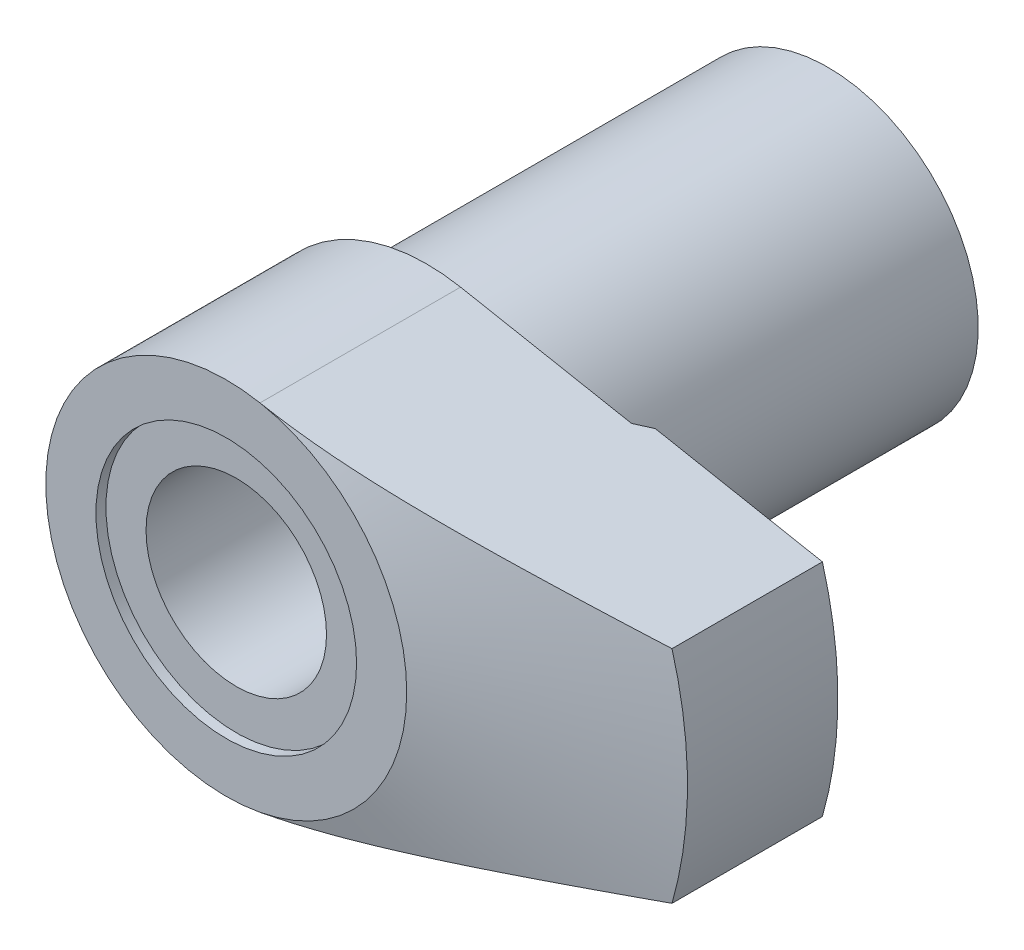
ISO-10303-21;
HEADER;
FILE_DESCRIPTION(('STEP AP214'),'2;1');
FILE_NAME('part.step','',(''),(''),'','','');
FILE_SCHEMA(('AUTOMOTIVE_DESIGN { 1 0 10303 214 1 1 1 1 }'));
ENDSEC;
DATA;
#1=APPLICATION_CONTEXT('core data for automotive mechanical design processes');
#2=APPLICATION_PROTOCOL_DEFINITION('international standard','automotive_design',2000,#1);
#3=PRODUCT_CONTEXT('',#1,'mechanical');
#4=PRODUCT('Part','Part','',(#3));
#5=PRODUCT_RELATED_PRODUCT_CATEGORY('part','',(#4));
#6=PRODUCT_DEFINITION_FORMATION('','',#4);
#7=PRODUCT_DEFINITION_CONTEXT('part definition',#1,'design');
#8=PRODUCT_DEFINITION('design','',#6,#7);
#9=PRODUCT_DEFINITION_SHAPE('','',#8);
#10=(LENGTH_UNIT() NAMED_UNIT(*) SI_UNIT(.MILLI.,.METRE.));
#11=(NAMED_UNIT(*) PLANE_ANGLE_UNIT() SI_UNIT($,.RADIAN.));
#12=(NAMED_UNIT(*) SI_UNIT($,.STERADIAN.) SOLID_ANGLE_UNIT());
#13=UNCERTAINTY_MEASURE_WITH_UNIT(LENGTH_MEASURE(1.E-05),#10,'distance_accuracy_value','');
#14=(GEOMETRIC_REPRESENTATION_CONTEXT(3) GLOBAL_UNCERTAINTY_ASSIGNED_CONTEXT((#13)) GLOBAL_UNIT_ASSIGNED_CONTEXT((#10,
#11,#12)) REPRESENTATION_CONTEXT('',''));
#15=CARTESIAN_POINT('',(0.,0.,0.));
#16=DIRECTION('',(0.,0.,1.));
#17=DIRECTION('',(1.,0.,0.));
#18=AXIS2_PLACEMENT_3D('',#15,#16,#17);
#19=CARTESIAN_POINT('',(38.4577690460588,11.,60.));
#20=DIRECTION('',(-0.18706704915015,-0.982347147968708,0.));
#21=DIRECTION('',(0.982347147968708,-0.18706704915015,0.));
#22=AXIS2_PLACEMENT_3D('',#19,#20,#21);
#23=PLANE('',#22);
#24=DIRECTION('',(0.982347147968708,-0.18706704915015,0.));
#25=VECTOR('',#24,1.);
#26=CARTESIAN_POINT('',(3.36720688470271,17.6822486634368,40.));
#27=LINE('',#26,#25);
#28=CARTESIAN_POINT('',(3.36720688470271,17.6822486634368,40.));
#29=VERTEX_POINT('',#28);
#30=CARTESIAN_POINT('',(20.4102929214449,14.4367566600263,40.));
#31=VERTEX_POINT('',#30);
#32=EDGE_CURVE('E76',#29,#31,#27,.T.);
#33=ORIENTED_EDGE('',*,*,#32,.F.);
#34=DIRECTION('',(0.,0.,-1.));
#35=VECTOR('',#34,1.);
#36=CARTESIAN_POINT('',(3.36720688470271,17.6822486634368,60.));
#37=LINE('',#36,#35);
#38=CARTESIAN_POINT('',(3.36720688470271,17.6822486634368,60.));
#39=VERTEX_POINT('',#38);
#40=EDGE_CURVE('E80',#39,#29,#37,.T.);
#41=ORIENTED_EDGE('',*,*,#40,.F.);
#42=CARTESIAN_POINT('',(3.36700688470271,17.6822867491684,59.999999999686));
#43=CARTESIAN_POINT('',(3.74617143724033,17.6100829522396,60.0000170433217));
#44=CARTESIAN_POINT('',(4.12533376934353,17.5378795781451,59.9966168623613));
#45=CARTESIAN_POINT('',(4.88353400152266,17.3934965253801,59.9830982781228));
#46=CARTESIAN_POINT('',(5.26257190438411,17.3213168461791,59.9729800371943));
#47=CARTESIAN_POINT('',(6.02031137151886,17.1770215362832,59.9461454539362));
#48=CARTESIAN_POINT('',(6.39901300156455,17.1049058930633,59.9294310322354));
#49=CARTESIAN_POINT('',(7.15609074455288,16.9607365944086,59.889627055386));
#50=CARTESIAN_POINT('',(7.53446685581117,16.8886829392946,59.8665374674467));
#51=CARTESIAN_POINT('',(8.66762905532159,16.672896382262,59.7882071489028));
#52=CARTESIAN_POINT('',(9.42182029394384,16.5292767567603,59.7238544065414));
#53=CARTESIAN_POINT('',(10.9281433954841,16.2424296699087,59.573607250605));
#54=CARTESIAN_POINT('',(11.6802750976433,16.0992022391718,59.4877112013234));
#55=CARTESIAN_POINT('',(13.1799693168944,15.813617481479,59.2977850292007));
#56=CARTESIAN_POINT('',(13.9275387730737,15.671258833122,59.1938111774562));
#57=CARTESIAN_POINT('',(15.4204330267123,15.3869689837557,58.9705298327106));
#58=CARTESIAN_POINT('',(16.1657578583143,15.2450377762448,58.8512225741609));
#59=CARTESIAN_POINT('',(17.6547023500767,14.9615000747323,58.5998721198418));
#60=CARTESIAN_POINT('',(18.398320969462,14.8198937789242,58.4678225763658));
#61=CARTESIAN_POINT('',(19.8836918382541,14.5370365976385,58.1933051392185));
#62=CARTESIAN_POINT('',(20.6254440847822,14.395785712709,58.0508372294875));
#63=CARTESIAN_POINT('',(22.0819191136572,14.1184311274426,57.7623832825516));
#64=CARTESIAN_POINT('',(22.796697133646,13.9823169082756,57.6166850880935));
#65=CARTESIAN_POINT('',(24.2249196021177,13.7103424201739,57.3186921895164));
#66=CARTESIAN_POINT('',(24.9383640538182,13.5744821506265,57.1663975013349));
#67=CARTESIAN_POINT('',(26.3639555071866,13.3030086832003,56.8563598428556));
#68=CARTESIAN_POINT('',(27.0761027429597,13.1673954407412,56.6986179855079));
#69=CARTESIAN_POINT('',(28.4994050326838,12.8963578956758,56.3785599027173));
#70=CARTESIAN_POINT('',(29.2105600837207,12.7609335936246,56.2162436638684));
#71=CARTESIAN_POINT('',(30.6340798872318,12.4898546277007,55.8872925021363));
#72=CARTESIAN_POINT('',(31.3464421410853,12.3542004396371,55.7206463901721));
#73=CARTESIAN_POINT('',(32.7704223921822,12.0830337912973,55.3840902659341));
#74=CARTESIAN_POINT('',(33.482040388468,11.9475213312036,55.2141802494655));
#75=CARTESIAN_POINT('',(34.904700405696,11.6766060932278,54.8715742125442));
#76=CARTESIAN_POINT('',(35.6157423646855,11.5412033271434,54.6988779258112));
#77=CARTESIAN_POINT('',(37.0372592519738,11.2705057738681,54.3511037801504));
#78=CARTESIAN_POINT('',(37.7477341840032,11.1352109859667,54.1760259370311));
#79=CARTESIAN_POINT('',(38.4579690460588,10.9999619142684,53.9999504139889));
#80=B_SPLINE_CURVE_WITH_KNOTS('',3,(#42,#43,#44,#45,#46,#47,#48,#49,#50,#51,#52,#53,#54,#55,#56,
#57,#58,#59,#60,#61,#62,#63,#64,#65,#66,#67,#68,#69,#70,#71,#72,#73,#74,#75,#76,#77,#78,#79),
.UNSPECIFIED.,.F.,.F.,(4,2,2,2,2,2,2,2,2,2,2,2,2,2,2,2,2,2,4),(0.,1.15791573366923,
2.31580348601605,3.47335434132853,4.63091115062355,6.94183624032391,9.25293684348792,
11.5569683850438,13.8609647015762,16.1661147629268,18.4712683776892,20.6974317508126,
22.9235897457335,25.1492955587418,27.3750078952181,29.6071945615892,31.8393840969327,
34.071788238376,36.3041775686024),.UNSPECIFIED.);
#81=CARTESIAN_POINT('',(38.4577690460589,11.,54.));
#82=VERTEX_POINT('',#81);
#83=EDGE_CURVE('E142',#39,#82,#80,.T.);
#84=ORIENTED_EDGE('',*,*,#83,.T.);
#85=DIRECTION('',(0.,0.,-1.));
#86=VECTOR('',#85,1.);
#87=CARTESIAN_POINT('',(38.4577690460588,11.,60.));
#88=LINE('',#87,#86);
#89=CARTESIAN_POINT('',(38.4577690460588,11.,39.));
#90=VERTEX_POINT('',#89);
#91=EDGE_CURVE('E99',#82,#90,#88,.T.);
#92=ORIENTED_EDGE('',*,*,#91,.T.);
#93=DIRECTION('',(-0.982347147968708,0.18706704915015,0.));
#94=VECTOR('',#93,1.);
#95=CARTESIAN_POINT('',(38.4577690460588,11.,39.));
#96=LINE('',#95,#94);
#97=CARTESIAN_POINT('',(21.7976730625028,14.1725597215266,39.));
#98=VERTEX_POINT('',#97);
#99=EDGE_CURVE('E198',#90,#98,#96,.T.);
#100=ORIENTED_EDGE('',*,*,#99,.T.);
#101=CARTESIAN_POINT('',(39.6395102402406,10.7749626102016,23.9221398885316));
#102=CARTESIAN_POINT('',(39.1146398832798,10.8749129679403,24.4023986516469));
#103=CARTESIAN_POINT('',(38.5888051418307,10.9750469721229,24.8815683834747));
#104=CARTESIAN_POINT('',(37.5349407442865,11.1757329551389,25.8374014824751));
#105=CARTESIAN_POINT('',(37.0069110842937,11.2762849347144,26.3140648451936));
#106=CARTESIAN_POINT('',(35.9482364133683,11.4778869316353,27.2646954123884));
#107=CARTESIAN_POINT('',(35.4175906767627,11.5789370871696,27.7386617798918));
#108=CARTESIAN_POINT('',(34.3535135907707,11.7815678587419,28.6833511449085));
#109=CARTESIAN_POINT('',(33.8200822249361,11.8831484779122,29.1540741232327));
#110=CARTESIAN_POINT('',(32.7450250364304,12.0878701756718,30.0962033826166));
#111=CARTESIAN_POINT('',(32.2033693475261,12.1910169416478,30.5675743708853));
#112=CARTESIAN_POINT('',(31.1163969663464,12.3980076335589,31.5058996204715));
#113=CARTESIAN_POINT('',(30.5710803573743,12.5018515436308,31.9728539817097));
#114=CARTESIAN_POINT('',(29.4763313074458,12.710323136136,32.9015335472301));
#115=CARTESIAN_POINT('',(28.926899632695,12.814950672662,33.3632596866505));
#116=CARTESIAN_POINT('',(27.8231284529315,13.0251403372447,34.2806981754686));
#117=CARTESIAN_POINT('',(27.2687885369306,13.1307025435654,34.7364100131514));
#118=CARTESIAN_POINT('',(26.2080043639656,13.3327062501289,35.597198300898));
#119=CARTESIAN_POINT('',(25.7020758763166,13.4290495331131,36.0029327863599));
#120=CARTESIAN_POINT('',(24.6849161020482,13.6227459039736,36.8074825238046));
#121=CARTESIAN_POINT('',(24.1736847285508,13.7200990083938,37.2062976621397));
#122=CARTESIAN_POINT('',(23.1451806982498,13.9159556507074,37.9956499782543));
#123=CARTESIAN_POINT('',(22.6279088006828,14.0144590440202,38.3861881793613));
#124=CARTESIAN_POINT('',(21.5863211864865,14.2128071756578,39.1573852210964));
#125=CARTESIAN_POINT('',(21.0620057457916,14.3126518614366,39.5380444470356));
#126=CARTESIAN_POINT('',(20.0061001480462,14.5137265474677,40.2867683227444));
#127=CARTESIAN_POINT('',(19.4745242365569,14.6149538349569,40.6548537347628));
#128=CARTESIAN_POINT('',(18.4018654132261,14.8192188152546,41.3764959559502));
#129=CARTESIAN_POINT('',(17.8607820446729,14.9222565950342,41.7300520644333));
#130=CARTESIAN_POINT('',(16.7680387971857,15.1303462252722,42.418948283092));
#131=CARTESIAN_POINT('',(16.2163868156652,15.2353965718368,42.7543013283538));
#132=CARTESIAN_POINT('',(15.1005362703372,15.4478864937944,43.4026429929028));
#133=CARTESIAN_POINT('',(14.5363396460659,15.555325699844,43.715635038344));
#134=CARTESIAN_POINT('',(13.6907919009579,15.7163422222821,44.1581191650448));
#135=CARTESIAN_POINT('',(13.4148800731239,15.7688837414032,44.2984167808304));
#136=CARTESIAN_POINT('',(12.8596450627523,15.8746163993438,44.5717671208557));
#137=CARTESIAN_POINT('',(12.580322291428,15.9278074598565,44.7048207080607));
#138=CARTESIAN_POINT('',(12.0181003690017,16.0348706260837,44.9628698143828));
#139=CARTESIAN_POINT('',(11.7352012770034,16.0887427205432,45.0878654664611));
#140=CARTESIAN_POINT('',(11.1656430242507,16.1972029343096,45.3289189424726));
#141=CARTESIAN_POINT('',(10.8789825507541,16.2517913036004,45.4449735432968));
#142=CARTESIAN_POINT('',(10.0150658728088,16.4163057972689,45.7775493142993));
#143=CARTESIAN_POINT('',(9.43218264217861,16.5273034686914,45.9792708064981));
#144=CARTESIAN_POINT('',(8.25249193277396,16.7519503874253,46.3344392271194));
#145=CARTESIAN_POINT('',(7.65569138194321,16.8655983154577,46.4879096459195));
#146=CARTESIAN_POINT('',(6.54454524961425,17.0771923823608,46.7187348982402));
#147=CARTESIAN_POINT('',(6.03184171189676,17.1748258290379,46.8042238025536));
#148=CARTESIAN_POINT('',(5.00115294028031,17.3710985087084,46.9308088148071));
#149=CARTESIAN_POINT('',(4.48316846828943,17.4697375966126,46.9719112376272));
#150=CARTESIAN_POINT('',(3.44602027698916,17.6672403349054,47.0075494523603));
#151=CARTESIAN_POINT('',(2.92685767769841,17.7661037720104,47.0021188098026));
#152=CARTESIAN_POINT('',(1.89092508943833,17.9633750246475,46.9450493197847));
#153=CARTESIAN_POINT('',(1.37415538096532,18.0617827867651,46.8934051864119));
#154=CARTESIAN_POINT('',(0.539125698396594,18.2207963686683,46.7741160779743));
#155=CARTESIAN_POINT('',(0.218966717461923,18.281763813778,46.719696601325));
#156=CARTESIAN_POINT('',(-0.418342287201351,18.4031257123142,46.5948720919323));
#157=CARTESIAN_POINT('',(-0.735492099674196,18.4635201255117,46.5244659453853));
#158=CARTESIAN_POINT('',(-1.68178154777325,18.6437207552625,46.2909440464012));
#159=CARTESIAN_POINT('',(-2.30568252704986,18.762529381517,46.1055365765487));
#160=CARTESIAN_POINT('',(-3.54092429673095,18.9977548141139,45.6842311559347));
#161=CARTESIAN_POINT('',(-4.15215747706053,19.1141511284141,45.4480137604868));
#162=CARTESIAN_POINT('',(-5.35800549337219,19.3437791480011,44.9356310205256));
#163=CARTESIAN_POINT('',(-5.95262226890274,19.4570112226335,44.6594703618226));
#164=CARTESIAN_POINT('',(-6.98949938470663,19.6544623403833,44.143551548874));
#165=CARTESIAN_POINT('',(-7.43494013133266,19.7392870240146,43.9103318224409));
#166=CARTESIAN_POINT('',(-8.31753020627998,19.9073574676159,43.4282483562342));
#167=CARTESIAN_POINT('',(-8.75467992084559,19.9906033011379,43.1793853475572));
#168=CARTESIAN_POINT('',(-9.61536148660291,20.1545017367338,42.6721395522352));
#169=CARTESIAN_POINT('',(-10.0389984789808,20.2351743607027,42.413940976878));
#170=CARTESIAN_POINT('',(-10.669486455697,20.3552373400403,42.0185885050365));
#171=CARTESIAN_POINT('',(-10.8787980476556,20.3950962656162,41.8854772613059));
#172=CARTESIAN_POINT('',(-11.2958668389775,20.4745181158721,41.6167685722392));
#173=CARTESIAN_POINT('',(-11.5036240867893,20.5140810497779,41.4811712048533));
#174=CARTESIAN_POINT('',(-11.7106532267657,20.5535053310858,41.3444302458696));
#175=B_SPLINE_CURVE_WITH_KNOTS('',3,(#101,#102,#103,#104,#105,#106,#107,#108,#109,#110,#111,
#112,#113,#114,#115,#116,#117,#118,#119,#120,#121,#122,#123,#124,#125,#126,#127,#128,#129,#130,
#131,#132,#133,#134,#135,#136,#137,#138,#139,#140,#141,#142,#143,#144,#145,#146,#147,#148,#149,
#150,#151,#152,#153,#154,#155,#156,#157,#158,#159,#160,#161,#162,#163,#164,#165,#166,#167,#168,
#169,#170,#171,#172,#173,#174),.UNSPECIFIED.,.F.,.F.,(4,2,2,2,2,2,2,2,2,2,2,2,2,2,2,2,2,2,2,2,2,
2,2,2,2,2,2,2,2,2,2,2,2,2,2,2,4),(0.,2.15526194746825,4.31052772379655,6.46642939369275,
8.62234380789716,10.7985561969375,12.9747192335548,15.1504866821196,17.3264380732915,
19.2933140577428,21.2602223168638,23.2268859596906,25.1934727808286,27.156637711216,
29.1198972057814,31.0817428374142,33.0432872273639,33.9850855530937,34.9267714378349,
35.8684417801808,36.8104500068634,38.6887950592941,40.5662242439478,42.1511135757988,
43.7357773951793,45.3192982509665,46.9030002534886,47.8938931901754,48.8848551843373,
50.8670209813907,52.862033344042,54.8568118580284,56.3862082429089,57.9155332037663,
59.4232479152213,60.176936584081,60.9306016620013),.UNSPECIFIED.);
#176=EDGE_CURVE('E83',#98,#31,#175,.T.);
#177=ORIENTED_EDGE('',*,*,#176,.T.);
#178=EDGE_LOOP('',(#33,#41,#84,#92,#100,#177));
#179=FACE_BOUND('',#178,.T.);
#180=ADVANCED_FACE('F15',(#179),#23,.F.);
#181=CARTESIAN_POINT('',(38.4577690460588,-11.,60.));
#182=DIRECTION('',(0.18706704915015,-0.982347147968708,0.));
#183=DIRECTION('',(0.982347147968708,0.18706704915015,0.));
#184=AXIS2_PLACEMENT_3D('',#181,#182,#183);
#185=PLANE('',#184);
#186=DIRECTION('',(0.,0.,-1.));
#187=VECTOR('',#186,1.);
#188=CARTESIAN_POINT('',(3.3672068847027,-17.6822486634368,60.));
#189=LINE('',#188,#187);
#190=CARTESIAN_POINT('',(3.3672068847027,-17.6822486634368,60.));
#191=VERTEX_POINT('',#190);
#192=CARTESIAN_POINT('',(3.3672068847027,-17.6822486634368,40.));
#193=VERTEX_POINT('',#192);
#194=EDGE_CURVE('E100',#191,#193,#189,.T.);
#195=ORIENTED_EDGE('',*,*,#194,.T.);
#196=DIRECTION('',(-0.982347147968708,-0.187067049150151,0.));
#197=VECTOR('',#196,1.);
#198=CARTESIAN_POINT('',(20.410292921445,-14.4367566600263,40.));
#199=LINE('',#198,#197);
#200=CARTESIAN_POINT('',(20.410292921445,-14.4367566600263,40.));
#201=VERTEX_POINT('',#200);
#202=EDGE_CURVE('E86',#201,#193,#199,.T.);
#203=ORIENTED_EDGE('',*,*,#202,.F.);
#204=CARTESIAN_POINT('',(39.6395102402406,-10.7749626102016,23.9221398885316));
#205=CARTESIAN_POINT('',(39.1146398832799,-10.8749129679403,24.4023986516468));
#206=CARTESIAN_POINT('',(38.5888051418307,-10.9750469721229,24.8815683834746));
#207=CARTESIAN_POINT('',(37.5349407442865,-11.1757329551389,25.8374014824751));
#208=CARTESIAN_POINT('',(37.0069110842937,-11.2762849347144,26.3140648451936));
#209=CARTESIAN_POINT('',(35.9482364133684,-11.4778869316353,27.2646954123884));
#210=CARTESIAN_POINT('',(35.4175906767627,-11.5789370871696,27.7386617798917));
#211=CARTESIAN_POINT('',(34.3535135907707,-11.7815678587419,28.6833511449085));
#212=CARTESIAN_POINT('',(33.8200822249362,-11.8831484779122,29.1540741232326));
#213=CARTESIAN_POINT('',(32.7450250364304,-12.0878701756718,30.0962033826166));
#214=CARTESIAN_POINT('',(32.2033693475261,-12.1910169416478,30.5675743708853));
#215=CARTESIAN_POINT('',(31.1163969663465,-12.3980076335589,31.5058996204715));
#216=CARTESIAN_POINT('',(30.5710803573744,-12.5018515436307,31.9728539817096));
#217=CARTESIAN_POINT('',(29.4763313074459,-12.710323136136,32.9015335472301));
#218=CARTESIAN_POINT('',(28.926899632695,-12.814950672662,33.3632596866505));
#219=CARTESIAN_POINT('',(27.8231284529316,-13.0251403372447,34.2806981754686));
#220=CARTESIAN_POINT('',(27.2687885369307,-13.1307025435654,34.7364100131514));
#221=CARTESIAN_POINT('',(26.2080043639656,-13.3327062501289,35.597198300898));
#222=CARTESIAN_POINT('',(25.7020758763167,-13.4290495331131,36.0029327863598));
#223=CARTESIAN_POINT('',(24.6849161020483,-13.6227459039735,36.8074825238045));
#224=CARTESIAN_POINT('',(24.1736847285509,-13.7200990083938,37.2062976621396));
#225=CARTESIAN_POINT('',(23.1451806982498,-13.9159556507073,37.9956499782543));
#226=CARTESIAN_POINT('',(22.6279088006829,-14.0144590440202,38.3861881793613));
#227=CARTESIAN_POINT('',(21.5863211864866,-14.2128071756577,39.1573852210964));
#228=CARTESIAN_POINT('',(21.0620057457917,-14.3126518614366,39.5380444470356));
#229=CARTESIAN_POINT('',(20.0061001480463,-14.5137265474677,40.2867683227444));
#230=CARTESIAN_POINT('',(19.474524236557,-14.6149538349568,40.6548537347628));
#231=CARTESIAN_POINT('',(18.4018654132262,-14.8192188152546,41.3764959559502));
#232=CARTESIAN_POINT('',(17.860782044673,-14.9222565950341,41.7300520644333));
#233=CARTESIAN_POINT('',(16.7680387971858,-15.1303462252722,42.418948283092));
#234=CARTESIAN_POINT('',(16.2163868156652,-15.2353965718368,42.7543013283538));
#235=CARTESIAN_POINT('',(15.1005362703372,-15.4478864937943,43.4026429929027));
#236=CARTESIAN_POINT('',(14.536339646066,-15.555325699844,43.715635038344));
#237=CARTESIAN_POINT('',(13.690791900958,-15.7163422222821,44.1581191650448));
#238=CARTESIAN_POINT('',(13.414880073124,-15.7688837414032,44.2984167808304));
#239=CARTESIAN_POINT('',(12.8596450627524,-15.8746163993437,44.5717671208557));
#240=CARTESIAN_POINT('',(12.5803222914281,-15.9278074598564,44.7048207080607));
#241=CARTESIAN_POINT('',(12.0181003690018,-16.0348706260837,44.9628698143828));
#242=CARTESIAN_POINT('',(11.7352012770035,-16.0887427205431,45.087865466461));
#243=CARTESIAN_POINT('',(11.1656430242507,-16.1972029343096,45.3289189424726));
#244=CARTESIAN_POINT('',(10.8789825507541,-16.2517913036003,45.4449735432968));
#245=CARTESIAN_POINT('',(10.0150658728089,-16.4163057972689,45.7775493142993));
#246=CARTESIAN_POINT('',(9.43218264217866,-16.5273034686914,45.9792708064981));
#247=CARTESIAN_POINT('',(8.252491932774,-16.7519503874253,46.3344392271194));
#248=CARTESIAN_POINT('',(7.65569138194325,-16.8655983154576,46.4879096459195));
#249=CARTESIAN_POINT('',(6.5445452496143,-17.0771923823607,46.7187348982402));
#250=CARTESIAN_POINT('',(6.0318417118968,-17.1748258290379,46.8042238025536));
#251=CARTESIAN_POINT('',(5.00115294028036,-17.3710985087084,46.9308088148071));
#252=CARTESIAN_POINT('',(4.48316846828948,-17.4697375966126,46.9719112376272));
#253=CARTESIAN_POINT('',(3.44602027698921,-17.6672403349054,47.0075494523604));
#254=CARTESIAN_POINT('',(2.92685767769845,-17.7661037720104,47.0021188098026));
#255=CARTESIAN_POINT('',(1.89092508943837,-17.9633750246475,46.9450493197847));
#256=CARTESIAN_POINT('',(1.37415538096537,-18.0617827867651,46.8934051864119));
#257=CARTESIAN_POINT('',(0.539125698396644,-18.2207963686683,46.7741160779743));
#258=CARTESIAN_POINT('',(0.218966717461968,-18.2817638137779,46.719696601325));
#259=CARTESIAN_POINT('',(-0.418342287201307,-18.4031257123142,46.5948720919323));
#260=CARTESIAN_POINT('',(-0.735492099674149,-18.4635201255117,46.5244659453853));
#261=CARTESIAN_POINT('',(-1.68178154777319,-18.6437207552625,46.2909440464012));
#262=CARTESIAN_POINT('',(-2.3056825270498,-18.7625293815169,46.1055365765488));
#263=CARTESIAN_POINT('',(-3.54092429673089,-18.9977548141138,45.6842311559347));
#264=CARTESIAN_POINT('',(-4.15215747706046,-19.1141511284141,45.4480137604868));
#265=CARTESIAN_POINT('',(-5.35800549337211,-19.3437791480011,44.9356310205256));
#266=CARTESIAN_POINT('',(-5.95262226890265,-19.4570112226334,44.6594703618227));
#267=CARTESIAN_POINT('',(-6.98949938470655,-19.6544623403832,44.1435515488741));
#268=CARTESIAN_POINT('',(-7.4349401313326,-19.7392870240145,43.9103318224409));
#269=CARTESIAN_POINT('',(-8.31753020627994,-19.9073574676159,43.4282483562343));
#270=CARTESIAN_POINT('',(-8.75467992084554,-19.9906033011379,43.1793853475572));
#271=CARTESIAN_POINT('',(-9.61536148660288,-20.1545017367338,42.6721395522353));
#272=CARTESIAN_POINT('',(-10.0389984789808,-20.2351743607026,42.413940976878));
#273=CARTESIAN_POINT('',(-10.669486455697,-20.3552373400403,42.0185885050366));
#274=CARTESIAN_POINT('',(-10.8787980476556,-20.3950962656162,41.8854772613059));
#275=CARTESIAN_POINT('',(-11.2958668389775,-20.474518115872,41.6167685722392));
#276=CARTESIAN_POINT('',(-11.5036240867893,-20.5140810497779,41.4811712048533));
#277=CARTESIAN_POINT('',(-11.7106532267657,-20.5535053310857,41.3444302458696));
#278=B_SPLINE_CURVE_WITH_KNOTS('',3,(#204,#205,#206,#207,#208,#209,#210,#211,#212,#213,#214,
#215,#216,#217,#218,#219,#220,#221,#222,#223,#224,#225,#226,#227,#228,#229,#230,#231,#232,#233,
#234,#235,#236,#237,#238,#239,#240,#241,#242,#243,#244,#245,#246,#247,#248,#249,#250,#251,#252,
#253,#254,#255,#256,#257,#258,#259,#260,#261,#262,#263,#264,#265,#266,#267,#268,#269,#270,#271,
#272,#273,#274,#275,#276,#277),.UNSPECIFIED.,.F.,.F.,(4,2,2,2,2,2,2,2,2,2,2,2,2,2,2,2,2,2,2,2,2,
2,2,2,2,2,2,2,2,2,2,2,2,2,2,2,4),(0.,2.15526194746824,4.31052772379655,6.46642939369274,
8.62234380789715,10.7985561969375,12.9747192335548,15.1504866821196,17.3264380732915,
19.2933140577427,21.2602223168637,23.2268859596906,25.1934727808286,27.1566377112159,
29.1198972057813,31.0817428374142,33.0432872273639,33.9850855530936,34.9267714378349,
35.8684417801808,36.8104500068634,38.6887950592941,40.5662242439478,42.1511135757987,
43.7357773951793,45.3192982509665,46.9030002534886,47.8938931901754,48.8848551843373,
50.8670209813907,52.862033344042,54.8568118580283,56.3862082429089,57.9155332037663,
59.4232479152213,60.176936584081,60.9306016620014),.UNSPECIFIED.);
#279=CARTESIAN_POINT('',(21.7976730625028,-14.1725597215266,39.));
#280=VERTEX_POINT('',#279);
#281=EDGE_CURVE('E9',#280,#201,#278,.T.);
#282=ORIENTED_EDGE('',*,*,#281,.F.);
#283=DIRECTION('',(-0.982347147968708,-0.18706704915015,0.));
#284=VECTOR('',#283,1.);
#285=CARTESIAN_POINT('',(38.4577690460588,-11.,39.));
#286=LINE('',#285,#284);
#287=CARTESIAN_POINT('',(38.4577690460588,-11.,39.));
#288=VERTEX_POINT('',#287);
#289=EDGE_CURVE('E29',#288,#280,#286,.T.);
#290=ORIENTED_EDGE('',*,*,#289,.F.);
#291=DIRECTION('',(0.,0.,-1.));
#292=VECTOR('',#291,1.);
#293=CARTESIAN_POINT('',(38.4577690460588,-11.,60.));
#294=LINE('',#293,#292);
#295=CARTESIAN_POINT('',(38.4577690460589,-11.,54.));
#296=VERTEX_POINT('',#295);
#297=EDGE_CURVE('E43',#296,#288,#294,.T.);
#298=ORIENTED_EDGE('',*,*,#297,.F.);
#299=CARTESIAN_POINT('',(3.3670068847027,-17.6822867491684,59.999999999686));
#300=CARTESIAN_POINT('',(3.74617143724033,-17.6100829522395,60.0000170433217));
#301=CARTESIAN_POINT('',(4.12533376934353,-17.537879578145,59.9966168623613));
#302=CARTESIAN_POINT('',(4.88353400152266,-17.39349652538,59.9830982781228));
#303=CARTESIAN_POINT('',(5.26257190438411,-17.3213168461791,59.9729800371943));
#304=CARTESIAN_POINT('',(6.02031137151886,-17.1770215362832,59.9461454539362));
#305=CARTESIAN_POINT('',(6.39901300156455,-17.1049058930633,59.9294310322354));
#306=CARTESIAN_POINT('',(7.15609074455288,-16.9607365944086,59.889627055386));
#307=CARTESIAN_POINT('',(7.53446685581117,-16.8886829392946,59.8665374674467));
#308=CARTESIAN_POINT('',(8.66762905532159,-16.672896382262,59.7882071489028));
#309=CARTESIAN_POINT('',(9.42182029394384,-16.5292767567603,59.7238544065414));
#310=CARTESIAN_POINT('',(10.9281433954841,-16.2424296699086,59.573607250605));
#311=CARTESIAN_POINT('',(11.6802750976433,-16.0992022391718,59.4877112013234));
#312=CARTESIAN_POINT('',(13.1799693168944,-15.813617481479,59.2977850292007));
#313=CARTESIAN_POINT('',(13.9275387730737,-15.671258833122,59.1938111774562));
#314=CARTESIAN_POINT('',(15.4204330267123,-15.3869689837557,58.9705298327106));
#315=CARTESIAN_POINT('',(16.1657578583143,-15.2450377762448,58.851222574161));
#316=CARTESIAN_POINT('',(17.6547023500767,-14.9615000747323,58.5998721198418));
#317=CARTESIAN_POINT('',(18.398320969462,-14.8198937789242,58.4678225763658));
#318=CARTESIAN_POINT('',(19.8836918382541,-14.5370365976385,58.1933051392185));
#319=CARTESIAN_POINT('',(20.6254440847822,-14.395785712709,58.0508372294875));
#320=CARTESIAN_POINT('',(22.0819191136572,-14.1184311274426,57.7623832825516));
#321=CARTESIAN_POINT('',(22.796697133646,-13.9823169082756,57.6166850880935));
#322=CARTESIAN_POINT('',(24.2249196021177,-13.7103424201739,57.3186921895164));
#323=CARTESIAN_POINT('',(24.9383640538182,-13.5744821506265,57.1663975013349));
#324=CARTESIAN_POINT('',(26.3639555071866,-13.3030086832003,56.8563598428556));
#325=CARTESIAN_POINT('',(27.0761027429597,-13.1673954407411,56.6986179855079));
#326=CARTESIAN_POINT('',(28.4994050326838,-12.8963578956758,56.3785599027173));
#327=CARTESIAN_POINT('',(29.2105600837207,-12.7609335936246,56.2162436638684));
#328=CARTESIAN_POINT('',(30.6340798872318,-12.4898546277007,55.8872925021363));
#329=CARTESIAN_POINT('',(31.3464421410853,-12.3542004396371,55.7206463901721));
#330=CARTESIAN_POINT('',(32.7704223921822,-12.0830337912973,55.3840902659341));
#331=CARTESIAN_POINT('',(33.482040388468,-11.9475213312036,55.2141802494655));
#332=CARTESIAN_POINT('',(34.904700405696,-11.6766060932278,54.8715742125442));
#333=CARTESIAN_POINT('',(35.6157423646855,-11.5412033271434,54.6988779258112));
#334=CARTESIAN_POINT('',(37.0372592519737,-11.2705057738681,54.3511037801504));
#335=CARTESIAN_POINT('',(37.7477341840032,-11.1352109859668,54.1760259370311));
#336=CARTESIAN_POINT('',(38.4579690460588,-10.9999619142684,53.9999504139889));
#337=B_SPLINE_CURVE_WITH_KNOTS('',3,(#299,#300,#301,#302,#303,#304,#305,#306,#307,#308,#309,
#310,#311,#312,#313,#314,#315,#316,#317,#318,#319,#320,#321,#322,#323,#324,#325,#326,#327,#328,
#329,#330,#331,#332,#333,#334,#335,#336),.UNSPECIFIED.,.F.,.F.,(4,2,2,2,2,2,2,2,2,2,2,2,2,2,2,2,
2,2,4),(0.,1.15791573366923,2.31580348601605,3.47335434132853,4.63091115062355,6.94183624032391,
9.25293684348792,11.5569683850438,13.8609647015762,16.1661147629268,18.4712683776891,
20.6974317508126,22.9235897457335,25.1492955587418,27.3750078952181,29.6071945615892,
31.8393840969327,34.0717882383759,36.3041775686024),.UNSPECIFIED.);
#338=EDGE_CURVE('E135',#191,#296,#337,.T.);
#339=ORIENTED_EDGE('',*,*,#338,.F.);
#340=EDGE_LOOP('',(#195,#203,#282,#290,#298,#339));
#341=FACE_BOUND('',#340,.T.);
#342=ADVANCED_FACE('F148',(#341),#185,.T.);
#343=CARTESIAN_POINT('',(0.,0.,60.));
#344=DIRECTION('',(0.,0.,-1.));
#345=DIRECTION('',(-1.,0.,0.));
#346=AXIS2_PLACEMENT_3D('',#343,#344,#345);
#347=CYLINDRICAL_SURFACE('',#346,18.);
#348=CARTESIAN_POINT('',(0.,0.,40.));
#349=DIRECTION('',(0.,0.,1.));
#350=DIRECTION('',(1.,0.,0.));
#351=AXIS2_PLACEMENT_3D('',#348,#349,#350);
#352=CIRCLE('',#351,18.);
#353=EDGE_CURVE('E89',#29,#193,#352,.T.);
#354=ORIENTED_EDGE('',*,*,#353,.T.);
#355=ORIENTED_EDGE('',*,*,#194,.F.);
#356=CARTESIAN_POINT('',(0.,0.,60.));
#357=DIRECTION('',(0.,0.,1.));
#358=DIRECTION('',(1.,0.,0.));
#359=AXIS2_PLACEMENT_3D('',#356,#357,#358);
#360=CIRCLE('',#359,18.);
#361=EDGE_CURVE('E98',#39,#191,#360,.T.);
#362=ORIENTED_EDGE('',*,*,#361,.F.);
#363=ORIENTED_EDGE('',*,*,#40,.T.);
#364=EDGE_LOOP('',(#354,#355,#362,#363));
#365=FACE_BOUND('',#364,.T.);
#366=ADVANCED_FACE('F97',(#365),#347,.T.);
#367=CARTESIAN_POINT('',(50.,20.,39.));
#368=DIRECTION('',(0.,0.,1.));
#369=DIRECTION('',(1.,0.,0.));
#370=AXIS2_PLACEMENT_3D('',#367,#368,#369);
#371=PLANE('',#370);
#372=ORIENTED_EDGE('',*,*,#289,.T.);
#373=CARTESIAN_POINT('',(0.,0.,39.));
#374=DIRECTION('',(0.,0.,1.));
#375=DIRECTION('',(1.,0.,0.));
#376=AXIS2_PLACEMENT_3D('',#373,#374,#375);
#377=CIRCLE('',#376,26.);
#378=EDGE_CURVE('E35',#280,#98,#377,.T.);
#379=ORIENTED_EDGE('',*,*,#378,.T.);
#380=ORIENTED_EDGE('',*,*,#99,.F.);
#381=CARTESIAN_POINT('',(0.,0.,39.));
#382=DIRECTION('',(0.,0.,1.));
#383=DIRECTION('',(1.,0.,0.));
#384=AXIS2_PLACEMENT_3D('',#381,#382,#383);
#385=CIRCLE('',#384,40.);
#386=EDGE_CURVE('E196',#288,#90,#385,.T.);
#387=ORIENTED_EDGE('',*,*,#386,.F.);
#388=EDGE_LOOP('',(#372,#379,#380,#387));
#389=FACE_BOUND('',#388,.T.);
#390=ADVANCED_FACE('F166',(#389),#371,.F.);
#391=CARTESIAN_POINT('',(0.,0.,0.));
#392=DIRECTION('',(0.,0.,-1.));
#393=DIRECTION('',(-1.,0.,0.));
#394=AXIS2_PLACEMENT_3D('',#391,#392,#393);
#395=CYLINDRICAL_SURFACE('',#394,9.);
#396=CARTESIAN_POINT('',(0.,0.,34.));
#397=DIRECTION('',(0.,0.,-1.));
#398=DIRECTION('',(-1.,0.,0.));
#399=AXIS2_PLACEMENT_3D('',#396,#397,#398);
#400=CIRCLE('',#399,9.);
#401=CARTESIAN_POINT('',(-9.,0.,34.));
#402=VERTEX_POINT('',#401);
#403=EDGE_CURVE('E127',#402,#402,#400,.T.);
#404=ORIENTED_EDGE('',*,*,#403,.T.);
#405=EDGE_LOOP('',(#404));
#406=FACE_BOUND('',#405,.T.);
#407=CARTESIAN_POINT('',(0.,0.,59.));
#408=DIRECTION('',(0.,0.,1.));
#409=DIRECTION('',(1.,0.,0.));
#410=AXIS2_PLACEMENT_3D('',#407,#408,#409);
#411=CIRCLE('',#410,9.);
#412=CARTESIAN_POINT('',(9.,0.,59.));
#413=VERTEX_POINT('',#412);
#414=EDGE_CURVE('E107',#413,#413,#411,.T.);
#415=ORIENTED_EDGE('',*,*,#414,.T.);
#416=EDGE_LOOP('',(#415));
#417=FACE_BOUND('',#416,.T.);
#418=ADVANCED_FACE('F159',(#406,#417),#395,.F.);
#419=CARTESIAN_POINT('',(0.,0.,0.));
#420=DIRECTION('',(0.,0.,1.));
#421=DIRECTION('',(1.,0.,0.));
#422=AXIS2_PLACEMENT_3D('',#419,#420,#421);
#423=PLANE('',#422);
#424=CARTESIAN_POINT('',(0.,0.,0.));
#425=DIRECTION('',(0.,0.,-1.));
#426=DIRECTION('',(-1.,0.,0.));
#427=AXIS2_PLACEMENT_3D('',#424,#425,#426);
#428=CIRCLE('',#427,15.);
#429=CARTESIAN_POINT('',(-15.,0.,0.));
#430=VERTEX_POINT('',#429);
#431=EDGE_CURVE('E199',#430,#430,#428,.T.);
#432=ORIENTED_EDGE('',*,*,#431,.T.);
#433=EDGE_LOOP('',(#432));
#434=FACE_BOUND('',#433,.T.);
#435=CARTESIAN_POINT('',(0.,0.,0.));
#436=DIRECTION('',(0.,0.,-1.));
#437=DIRECTION('',(-1.,0.,0.));
#438=AXIS2_PLACEMENT_3D('',#435,#436,#437);
#439=CIRCLE('',#438,11.5);
#440=CARTESIAN_POINT('',(-11.5,0.,0.));
#441=VERTEX_POINT('',#440);
#442=EDGE_CURVE('E109',#441,#441,#439,.T.);
#443=ORIENTED_EDGE('',*,*,#442,.F.);
#444=EDGE_LOOP('',(#443));
#445=FACE_BOUND('',#444,.T.);
#446=ADVANCED_FACE('F170',(#434,#445),#423,.F.);
#447=CARTESIAN_POINT('',(0.,0.,60.));
#448=DIRECTION('',(0.,0.,1.));
#449=DIRECTION('',(1.,0.,0.));
#450=AXIS2_PLACEMENT_3D('',#447,#448,#449);
#451=PLANE('',#450);
#452=CARTESIAN_POINT('',(0.,0.,60.));
#453=DIRECTION('',(0.,0.,1.));
#454=DIRECTION('',(1.,0.,0.));
#455=AXIS2_PLACEMENT_3D('',#452,#453,#454);
#456=CIRCLE('',#455,13.);
#457=CARTESIAN_POINT('',(13.,0.,60.));
#458=VERTEX_POINT('',#457);
#459=EDGE_CURVE('E117',#458,#458,#456,.T.);
#460=ORIENTED_EDGE('',*,*,#459,.F.);
#461=EDGE_LOOP('',(#460));
#462=FACE_BOUND('',#461,.T.);
#463=CARTESIAN_POINT('',(0.,0.,60.));
#464=DIRECTION('',(0.,0.,1.));
#465=DIRECTION('',(1.,0.,0.));
#466=AXIS2_PLACEMENT_3D('',#463,#464,#465);
#467=CIRCLE('',#466,18.);
#468=EDGE_CURVE('E130',#191,#39,#467,.T.);
#469=ORIENTED_EDGE('',*,*,#468,.T.);
#470=ORIENTED_EDGE('',*,*,#361,.T.);
#471=EDGE_LOOP('',(#469,#470));
#472=FACE_BOUND('',#471,.T.);
#473=ADVANCED_FACE('F173',(#462,#472),#451,.T.);
#474=CARTESIAN_POINT('',(0.,0.,60.));
#475=DIRECTION('',(0.,0.,-1.));
#476=DIRECTION('',(-1.,0.,0.));
#477=AXIS2_PLACEMENT_3D('',#474,#475,#476);
#478=CYLINDRICAL_SURFACE('',#477,40.);
#479=ORIENTED_EDGE('',*,*,#91,.F.);
#480=CARTESIAN_POINT('',(0.,0.,54.));
#481=DIRECTION('',(0.,0.,1.));
#482=DIRECTION('',(1.,0.,0.));
#483=AXIS2_PLACEMENT_3D('',#480,#481,#482);
#484=CIRCLE('',#483,40.);
#485=EDGE_CURVE('E133',#296,#82,#484,.T.);
#486=ORIENTED_EDGE('',*,*,#485,.F.);
#487=ORIENTED_EDGE('',*,*,#297,.T.);
#488=ORIENTED_EDGE('',*,*,#386,.T.);
#489=EDGE_LOOP('',(#479,#486,#487,#488));
#490=FACE_BOUND('',#489,.T.);
#491=ADVANCED_FACE('F164',(#490),#478,.T.);
#492=CARTESIAN_POINT('',(0.,0.,39.));
#493=DIRECTION('',(0.,0.,-1.));
#494=DIRECTION('',(-1.,0.,0.));
#495=AXIS2_PLACEMENT_3D('',#492,#493,#494);
#496=CYLINDRICAL_SURFACE('',#495,15.);
#497=ORIENTED_EDGE('',*,*,#431,.F.);
#498=EDGE_LOOP('',(#497));
#499=FACE_BOUND('',#498,.T.);
#500=CARTESIAN_POINT('',(0.,0.,40.));
#501=DIRECTION('',(0.,0.,1.));
#502=DIRECTION('',(1.,0.,0.));
#503=AXIS2_PLACEMENT_3D('',#500,#501,#502);
#504=CIRCLE('',#503,15.);
#505=CARTESIAN_POINT('',(15.,0.,40.));
#506=VERTEX_POINT('',#505);
#507=EDGE_CURVE('E95',#506,#506,#504,.T.);
#508=ORIENTED_EDGE('',*,*,#507,.F.);
#509=EDGE_LOOP('',(#508));
#510=FACE_BOUND('',#509,.T.);
#511=ADVANCED_FACE('F157',(#499,#510),#496,.T.);
#512=CARTESIAN_POINT('',(0.,0.,54.));
#513=DIRECTION('',(0.,0.,-1.));
#514=DIRECTION('',(-1.,0.,0.));
#515=AXIS2_PLACEMENT_3D('',#512,#513,#514);
#516=CONICAL_SURFACE('',#515,40.,1.30454427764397);
#517=ORIENTED_EDGE('',*,*,#468,.F.);
#518=ORIENTED_EDGE('',*,*,#338,.T.);
#519=ORIENTED_EDGE('',*,*,#485,.T.);
#520=ORIENTED_EDGE('',*,*,#83,.F.);
#521=EDGE_LOOP('',(#517,#518,#519,#520));
#522=FACE_BOUND('',#521,.T.);
#523=ADVANCED_FACE('F151',(#522),#516,.T.);
#524=CARTESIAN_POINT('',(9.,0.,34.));
#525=DIRECTION('',(0.,0.,-1.));
#526=DIRECTION('',(-1.,0.,0.));
#527=AXIS2_PLACEMENT_3D('',#524,#525,#526);
#528=PLANE('',#527);
#529=CARTESIAN_POINT('',(0.,0.,34.));
#530=DIRECTION('',(0.,0.,-1.));
#531=DIRECTION('',(-1.,0.,0.));
#532=AXIS2_PLACEMENT_3D('',#529,#530,#531);
#533=CIRCLE('',#532,11.5);
#534=CARTESIAN_POINT('',(-11.5,0.,34.));
#535=VERTEX_POINT('',#534);
#536=EDGE_CURVE('E114',#535,#535,#533,.T.);
#537=ORIENTED_EDGE('',*,*,#536,.T.);
#538=EDGE_LOOP('',(#537));
#539=FACE_BOUND('',#538,.T.);
#540=ORIENTED_EDGE('',*,*,#403,.F.);
#541=EDGE_LOOP('',(#540));
#542=FACE_BOUND('',#541,.T.);
#543=ADVANCED_FACE('F156',(#539,#542),#528,.T.);
#544=CARTESIAN_POINT('',(0.,0.,0.));
#545=DIRECTION('',(0.,0.,-1.));
#546=DIRECTION('',(-1.,0.,0.));
#547=AXIS2_PLACEMENT_3D('',#544,#545,#546);
#548=CYLINDRICAL_SURFACE('',#547,11.5);
#549=ORIENTED_EDGE('',*,*,#442,.T.);
#550=EDGE_LOOP('',(#549));
#551=FACE_BOUND('',#550,.T.);
#552=ORIENTED_EDGE('',*,*,#536,.F.);
#553=EDGE_LOOP('',(#552));
#554=FACE_BOUND('',#553,.T.);
#555=ADVANCED_FACE('F227',(#551,#554),#548,.F.);
#556=CARTESIAN_POINT('',(0.,0.,59.));
#557=DIRECTION('',(0.,0.,1.));
#558=DIRECTION('',(1.,0.,0.));
#559=AXIS2_PLACEMENT_3D('',#556,#557,#558);
#560=CYLINDRICAL_SURFACE('',#559,13.);
#561=CARTESIAN_POINT('',(0.,0.,59.));
#562=DIRECTION('',(0.,0.,1.));
#563=DIRECTION('',(1.,0.,0.));
#564=AXIS2_PLACEMENT_3D('',#561,#562,#563);
#565=CIRCLE('',#564,13.);
#566=CARTESIAN_POINT('',(13.,0.,59.));
#567=VERTEX_POINT('',#566);
#568=EDGE_CURVE('E110',#567,#567,#565,.T.);
#569=ORIENTED_EDGE('',*,*,#568,.F.);
#570=EDGE_LOOP('',(#569));
#571=FACE_BOUND('',#570,.T.);
#572=ORIENTED_EDGE('',*,*,#459,.T.);
#573=EDGE_LOOP('',(#572));
#574=FACE_BOUND('',#573,.T.);
#575=ADVANCED_FACE('F220',(#571,#574),#560,.F.);
#576=CARTESIAN_POINT('',(0.,0.,59.));
#577=DIRECTION('',(0.,0.,1.));
#578=DIRECTION('',(1.,0.,0.));
#579=AXIS2_PLACEMENT_3D('',#576,#577,#578);
#580=PLANE('',#579);
#581=ORIENTED_EDGE('',*,*,#414,.F.);
#582=EDGE_LOOP('',(#581));
#583=FACE_BOUND('',#582,.T.);
#584=ORIENTED_EDGE('',*,*,#568,.T.);
#585=EDGE_LOOP('',(#584));
#586=FACE_BOUND('',#585,.T.);
#587=ADVANCED_FACE('F213',(#583,#586),#580,.T.);
#588=CARTESIAN_POINT('',(-15.,0.,40.));
#589=DIRECTION('',(0.,0.,-1.));
#590=DIRECTION('',(-1.,0.,0.));
#591=AXIS2_PLACEMENT_3D('',#588,#589,#590);
#592=PLANE('',#591);
#593=ORIENTED_EDGE('',*,*,#507,.T.);
#594=EDGE_LOOP('',(#593));
#595=FACE_BOUND('',#594,.T.);
#596=ORIENTED_EDGE('',*,*,#353,.F.);
#597=ORIENTED_EDGE('',*,*,#32,.T.);
#598=CARTESIAN_POINT('',(0.,0.,40.));
#599=DIRECTION('',(0.,0.,1.));
#600=DIRECTION('',(1.,0.,0.));
#601=AXIS2_PLACEMENT_3D('',#598,#599,#600);
#602=CIRCLE('',#601,25.);
#603=EDGE_CURVE('E340',#201,#31,#602,.T.);
#604=ORIENTED_EDGE('',*,*,#603,.F.);
#605=ORIENTED_EDGE('',*,*,#202,.T.);
#606=EDGE_LOOP('',(#596,#597,#604,#605));
#607=FACE_BOUND('',#606,.T.);
#608=ADVANCED_FACE('F90',(#595,#607),#592,.T.);
#609=CARTESIAN_POINT('',(0.,0.,40.));
#610=DIRECTION('',(0.,0.,-1.));
#611=DIRECTION('',(-1.,0.,0.));
#612=AXIS2_PLACEMENT_3D('',#609,#610,#611);
#613=CONICAL_SURFACE('',#612,25.,0.785398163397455);
#614=ORIENTED_EDGE('',*,*,#378,.F.);
#615=ORIENTED_EDGE('',*,*,#281,.T.);
#616=ORIENTED_EDGE('',*,*,#603,.T.);
#617=ORIENTED_EDGE('',*,*,#176,.F.);
#618=EDGE_LOOP('',(#614,#615,#616,#617));
#619=FACE_BOUND('',#618,.T.);
#620=ADVANCED_FACE('F212',(#619),#613,.F.);
#621=CLOSED_SHELL('',(#180,#342,#366,#390,#418,#446,#473,#491,#511,#523,#543,#555,#575,#587,
#608,#620));
#622=MANIFOLD_SOLID_BREP('B1',#621);
#623=ADVANCED_BREP_SHAPE_REPRESENTATION('',(#18,#622),#14);
#624=SHAPE_DEFINITION_REPRESENTATION(#9,#623);
ENDSEC;
END-ISO-10303-21;
